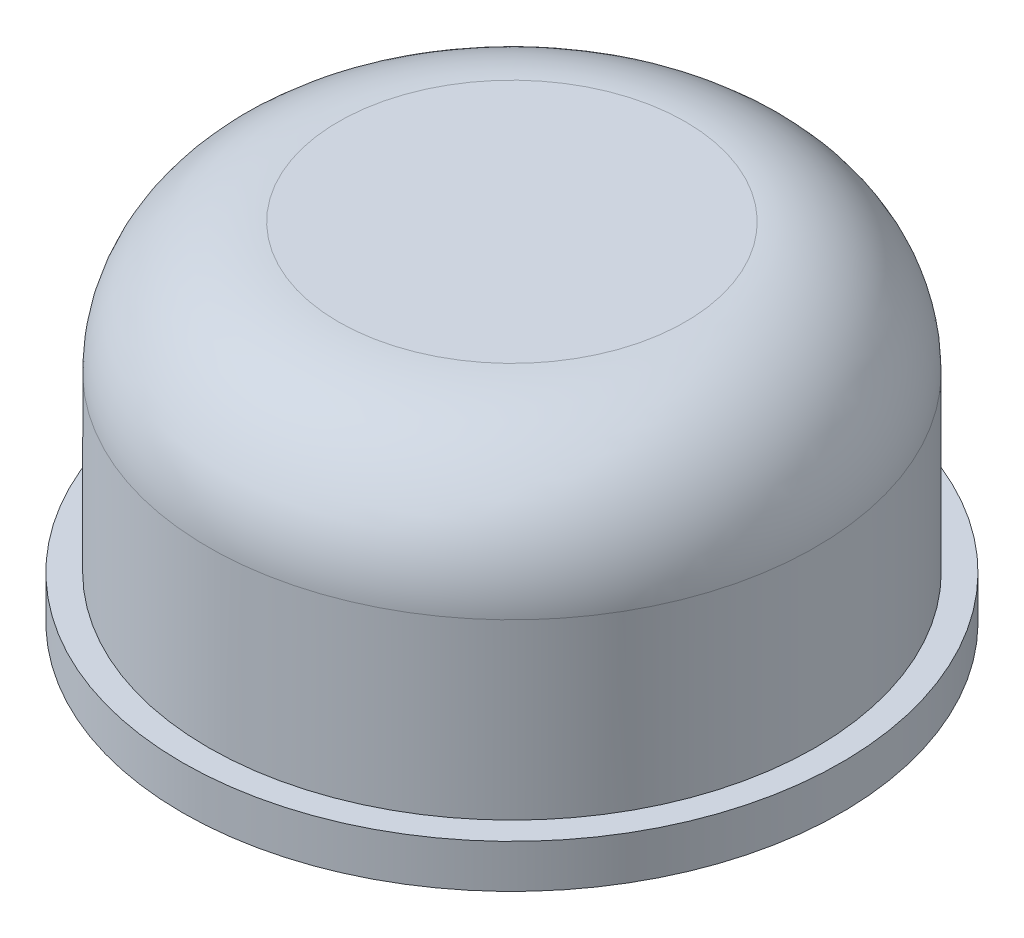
from build123d import *
from build123d.topology import SkipClean

# Parameters (mm, degrees)
BODY_ANGLE   = 180
INSIDE_ANGLE = 180
LIP_START    = 1.27
SKETCH4_R    = 9.652
SKETCH4_R_2  = 8.89
LIP_DEPTH    = 1.27


with BuildPart() as part:
    # Sketch1 → Body (revolve)
    with BuildSketch(Plane.XY):
        with BuildLine():
            Line((0, 0), (8.89, 0))
            Line((8.89, 0), (8.89, 6.35))
            ThreePointArc((8.89, 6.35), (7.774076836, 9.044076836), (5.08, 10.16))
            Line((5.08, 10.16), (0, 10.16))
            Line((0, 10.16), (0, 0))
        make_face()
    revolve(axis=Axis((0, 0, 0), (0, 1, 0)), revolution_arc=BODY_ANGLE)

    # Sketch2 → Inside (revolve, cut)
    with BuildSketch(Plane.XY):
        with BuildLine():
            Line((0, 0), (8.128, 0))
            Line((8.128, 0), (8.128, 5.842))
            ThreePointArc((8.128, 5.842), (7.235261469, 7.997261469), (5.08, 8.89))
            Line((5.08, 8.89), (0, 8.89))
            Line((0, 8.89), (0, 0))
        make_face()
    revolve(axis=Axis((0, 0, 0), (0, 1, 0)), revolution_arc=INSIDE_ANGLE, mode=Mode.SUBTRACT)

    # Mirror 2: part across face


with BuildPart() as part_1:
    with SkipClean():  # the faces are left unmerged after this step: merging them gives an invalid solid
        add(part.part)
        add(part.part.mirror(Plane(origin=(0, 7.378791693, 0), x_dir=(1, 0, 0), z_dir=(0, 0, 1))))

    # Sketch4 → Lip (add)
    with SkipClean():  # the faces are left unmerged after this step: merging them gives an invalid solid
        with BuildSketch(Plane(origin=(0, 0, 0), x_dir=(1, 0, 0), z_dir=(0, 1, 0)).offset(LIP_START)):
            with Locations(Location((0, 0, 0), (0, 0, 270))):
                Circle(SKETCH4_R)
            with Locations(Location((0, 0, 0), (0, 0, 90))):
                Circle(SKETCH4_R_2, mode=Mode.SUBTRACT)
        extrude(amount=-LIP_DEPTH)


solid = part_1.part
